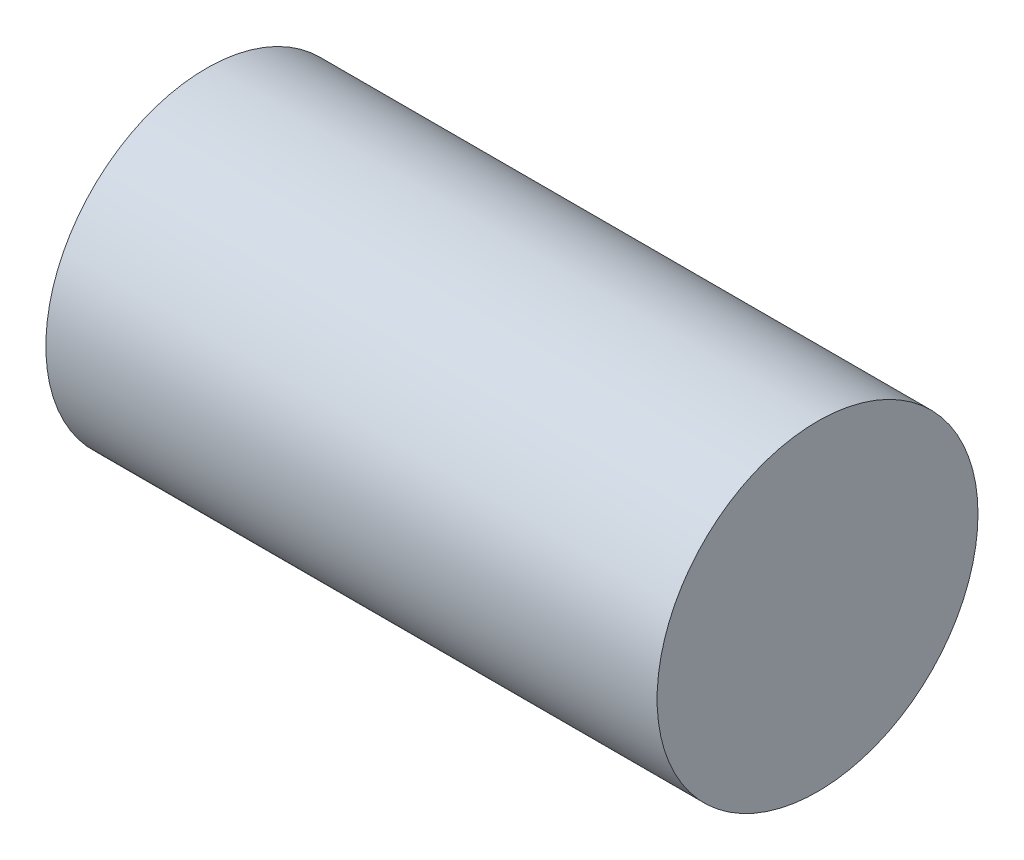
ISO-10303-21;
HEADER;
FILE_DESCRIPTION(('STEP AP214'),'2;1');
FILE_NAME('part.step','',(''),(''),'','','');
FILE_SCHEMA(('AUTOMOTIVE_DESIGN { 1 0 10303 214 1 1 1 1 }'));
ENDSEC;
DATA;
#1=APPLICATION_CONTEXT('core data for automotive mechanical design processes');
#2=APPLICATION_PROTOCOL_DEFINITION('international standard','automotive_design',2000,#1);
#3=PRODUCT_CONTEXT('',#1,'mechanical');
#4=PRODUCT('Part','Part','',(#3));
#5=PRODUCT_RELATED_PRODUCT_CATEGORY('part','',(#4));
#6=PRODUCT_DEFINITION_FORMATION('','',#4);
#7=PRODUCT_DEFINITION_CONTEXT('part definition',#1,'design');
#8=PRODUCT_DEFINITION('design','',#6,#7);
#9=PRODUCT_DEFINITION_SHAPE('','',#8);
#10=(LENGTH_UNIT() NAMED_UNIT(*) SI_UNIT(.MILLI.,.METRE.));
#11=(NAMED_UNIT(*) PLANE_ANGLE_UNIT() SI_UNIT($,.RADIAN.));
#12=(NAMED_UNIT(*) SI_UNIT($,.STERADIAN.) SOLID_ANGLE_UNIT());
#13=UNCERTAINTY_MEASURE_WITH_UNIT(LENGTH_MEASURE(1.E-05),#10,'distance_accuracy_value','');
#14=(GEOMETRIC_REPRESENTATION_CONTEXT(3) GLOBAL_UNCERTAINTY_ASSIGNED_CONTEXT((#13)) GLOBAL_UNIT_ASSIGNED_CONTEXT((#10,
#11,#12)) REPRESENTATION_CONTEXT('',''));
#15=CARTESIAN_POINT('',(0.,0.,0.));
#16=DIRECTION('',(0.,0.,1.));
#17=DIRECTION('',(1.,0.,0.));
#18=AXIS2_PLACEMENT_3D('',#15,#16,#17);
#19=CARTESIAN_POINT('',(80.,14.1087242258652,31.2490751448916));
#20=DIRECTION('',(-1.,0.,0.));
#21=DIRECTION('',(0.,0.,1.));
#22=AXIS2_PLACEMENT_3D('',#19,#20,#21);
#23=CYLINDRICAL_SURFACE('',#22,21.);
#24=CARTESIAN_POINT('',(80.,14.1087242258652,31.2490751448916));
#25=DIRECTION('',(1.,0.,0.));
#26=DIRECTION('',(0.,0.,-1.));
#27=AXIS2_PLACEMENT_3D('',#24,#25,#26);
#28=CIRCLE('',#27,21.);
#29=CARTESIAN_POINT('',(80.,14.1087242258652,10.2490751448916));
#30=VERTEX_POINT('',#29);
#31=EDGE_CURVE('E10',#30,#30,#28,.T.);
#32=ORIENTED_EDGE('',*,*,#31,.F.);
#33=EDGE_LOOP('',(#32));
#34=FACE_BOUND('',#33,.T.);
#35=CARTESIAN_POINT('',(0.,14.1087242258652,31.2490751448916));
#36=DIRECTION('',(1.,0.,0.));
#37=DIRECTION('',(0.,0.,-1.));
#38=AXIS2_PLACEMENT_3D('',#35,#36,#37);
#39=CIRCLE('',#38,21.);
#40=CARTESIAN_POINT('',(0.,14.1087242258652,10.2490751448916));
#41=VERTEX_POINT('',#40);
#42=EDGE_CURVE('E40',#41,#41,#39,.T.);
#43=ORIENTED_EDGE('',*,*,#42,.T.);
#44=EDGE_LOOP('',(#43));
#45=FACE_BOUND('',#44,.T.);
#46=ADVANCED_FACE('F37',(#34,#45),#23,.T.);
#47=CARTESIAN_POINT('',(80.,14.1087242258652,31.2490751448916));
#48=DIRECTION('',(1.,0.,0.));
#49=DIRECTION('',(0.,0.,-1.));
#50=AXIS2_PLACEMENT_3D('',#47,#48,#49);
#51=PLANE('',#50);
#52=ORIENTED_EDGE('',*,*,#31,.T.);
#53=EDGE_LOOP('',(#52));
#54=FACE_BOUND('',#53,.T.);
#55=ADVANCED_FACE('F52',(#54),#51,.T.);
#56=CARTESIAN_POINT('',(0.,14.1087242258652,31.2490751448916));
#57=DIRECTION('',(1.,0.,0.));
#58=DIRECTION('',(0.,0.,-1.));
#59=AXIS2_PLACEMENT_3D('',#56,#57,#58);
#60=PLANE('',#59);
#61=ORIENTED_EDGE('',*,*,#42,.F.);
#62=EDGE_LOOP('',(#61));
#63=FACE_BOUND('',#62,.T.);
#64=ADVANCED_FACE('F50',(#63),#60,.F.);
#65=CLOSED_SHELL('',(#46,#55,#64));
#66=MANIFOLD_SOLID_BREP('B2',#65);
#67=ADVANCED_BREP_SHAPE_REPRESENTATION('',(#18,#66),#14);
#68=SHAPE_DEFINITION_REPRESENTATION(#9,#67);
ENDSEC;
END-ISO-10303-21;
